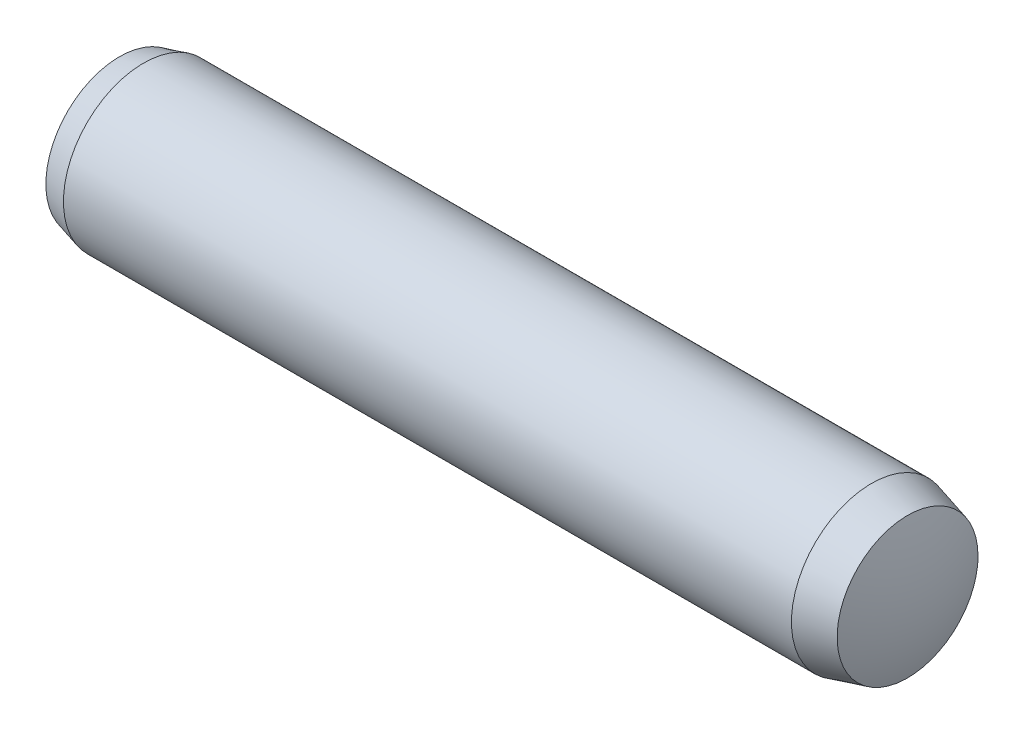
from build123d import *

# Parameters (mm, degrees)
ENL_V_MAT_EXTRU_1_DEPTH      = 40
ENL_V_MAT_EXTRU_1_DEPTH_BACK = 40


with BuildPart() as part:
    # Esquisse1 → R_volution1 (revolve)
    with BuildSketch(Plane(origin=(0, 0, 0), x_dir=(1, 0, 0), z_dir=(0, 1, 0))):
        with BuildLine():
            Line((9.960474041, 0), (8.8, 2.01))
            Line((8.8, 2.01), (0.8, 2.01))
            Line((0.8, 2.01), (0.8, 3.25))
            Line((0.8, 3.25), (0, 3.25))
            Line((0, 3.25), (0, 3.678460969))
            Line((0, 3.678460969), (1.2, 4))
            Line((1.2, 4), (37.56, 4))
            Line((37.56, 4), (39.360965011, 3.51743288))
            ThreePointArc((39.360965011, 3.51743288), (39.838944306, 1.787505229), (40, 0))
            Line((40, 0), (9.960474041, 0))
        make_face()
    revolve(axis=Axis((40, 0, 0), (-1, 0, 0)))

    # Esquisse2 → Enl_v. mat.-Extru.1 (cut, two sides: drawn at the far end of the back side and taken through both)
    with BuildSketch(Plane.ZY.offset(-0.8).offset(-ENL_V_MAT_EXTRU_1_DEPTH_BACK)):
        with BuildLine():
            Line((-3.968626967, -0.5), (-3.968626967, 0.5))
            Line((-3.968626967, 0.5), (-4.974937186, 0.5))
            ThreePointArc((-4.974937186, 0.5), (-5, 0), (-4.974937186, -0.5))
            Line((-4.974937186, -0.5), (-3.968626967, -0.5))
        make_face()
    extrude(amount=ENL_V_MAT_EXTRU_1_DEPTH + ENL_V_MAT_EXTRU_1_DEPTH_BACK, mode=Mode.SUBTRACT)


solid = part.part
